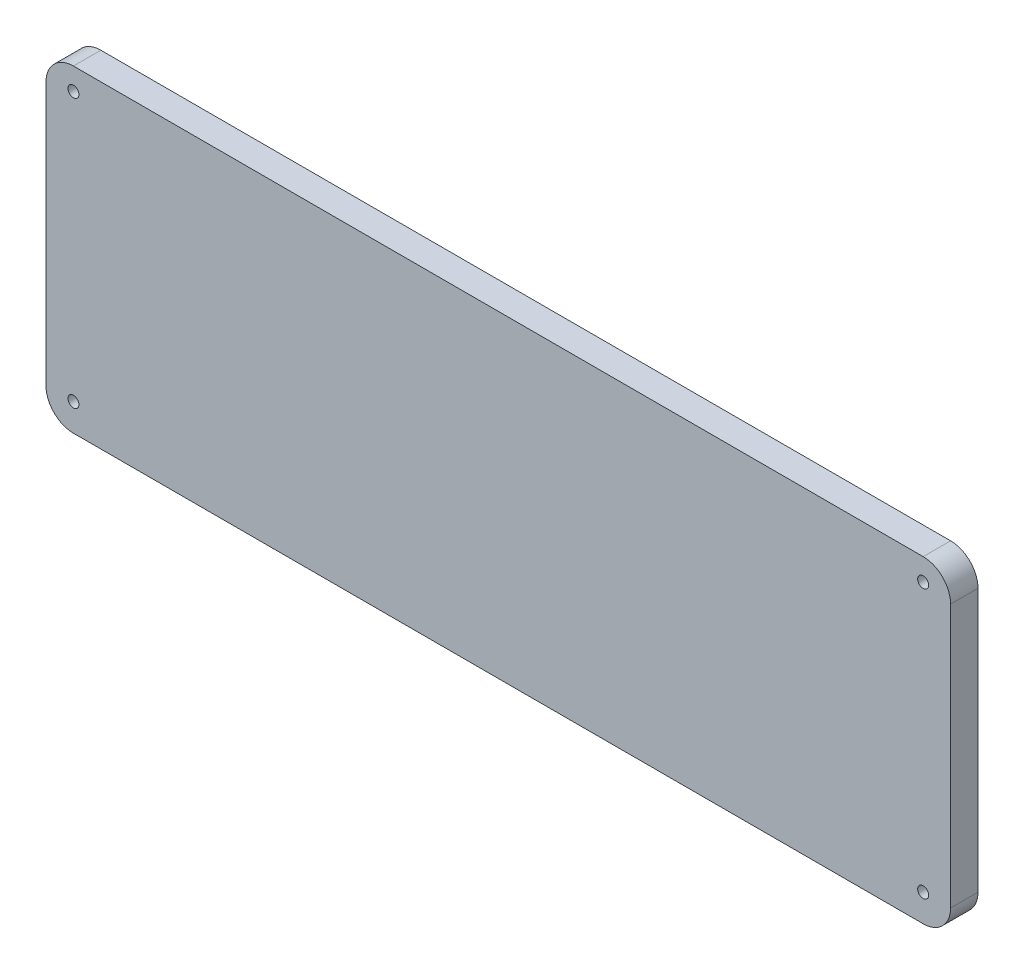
ISO-10303-21;
HEADER;
FILE_DESCRIPTION(('STEP AP214'),'2;1');
FILE_NAME('part.step','',(''),(''),'','','');
FILE_SCHEMA(('AUTOMOTIVE_DESIGN { 1 0 10303 214 1 1 1 1 }'));
ENDSEC;
DATA;
#1=APPLICATION_CONTEXT('core data for automotive mechanical design processes');
#2=APPLICATION_PROTOCOL_DEFINITION('international standard','automotive_design',2000,#1);
#3=PRODUCT_CONTEXT('',#1,'mechanical');
#4=PRODUCT('Part','Part','',(#3));
#5=PRODUCT_RELATED_PRODUCT_CATEGORY('part','',(#4));
#6=PRODUCT_DEFINITION_FORMATION('','',#4);
#7=PRODUCT_DEFINITION_CONTEXT('part definition',#1,'design');
#8=PRODUCT_DEFINITION('design','',#6,#7);
#9=PRODUCT_DEFINITION_SHAPE('','',#8);
#10=(LENGTH_UNIT() NAMED_UNIT(*) SI_UNIT(.MILLI.,.METRE.));
#11=(NAMED_UNIT(*) PLANE_ANGLE_UNIT() SI_UNIT($,.RADIAN.));
#12=(NAMED_UNIT(*) SI_UNIT($,.STERADIAN.) SOLID_ANGLE_UNIT());
#13=UNCERTAINTY_MEASURE_WITH_UNIT(LENGTH_MEASURE(1.E-05),#10,'distance_accuracy_value','');
#14=(GEOMETRIC_REPRESENTATION_CONTEXT(3) GLOBAL_UNCERTAINTY_ASSIGNED_CONTEXT((#13)) GLOBAL_UNIT_ASSIGNED_CONTEXT((#10,
#11,#12)) REPRESENTATION_CONTEXT('',''));
#15=CARTESIAN_POINT('',(0.,0.,0.));
#16=DIRECTION('',(0.,0.,1.));
#17=DIRECTION('',(1.,0.,0.));
#18=AXIS2_PLACEMENT_3D('',#15,#16,#17);
#19=CARTESIAN_POINT('',(165.,-58.,10.));
#20=DIRECTION('',(-1.,0.,0.));
#21=DIRECTION('',(0.,0.,1.));
#22=AXIS2_PLACEMENT_3D('',#19,#20,#21);
#23=PLANE('',#22);
#24=DIRECTION('',(0.,1.,0.));
#25=VECTOR('',#24,1.);
#26=CARTESIAN_POINT('',(165.,-58.,0.));
#27=LINE('',#26,#25);
#28=CARTESIAN_POINT('',(165.,-48.,0.));
#29=VERTEX_POINT('',#28);
#30=CARTESIAN_POINT('',(165.,48.,0.));
#31=VERTEX_POINT('',#30);
#32=EDGE_CURVE('E128',#29,#31,#27,.T.);
#33=ORIENTED_EDGE('',*,*,#32,.T.);
#34=DIRECTION('',(0.,0.,-1.));
#35=VECTOR('',#34,1.);
#36=CARTESIAN_POINT('',(165.,48.,10.));
#37=LINE('',#36,#35);
#38=CARTESIAN_POINT('',(165.,48.,10.));
#39=VERTEX_POINT('',#38);
#40=EDGE_CURVE('E106',#31,#39,#37,.F.);
#41=ORIENTED_EDGE('',*,*,#40,.T.);
#42=DIRECTION('',(0.,1.,0.));
#43=VECTOR('',#42,1.);
#44=CARTESIAN_POINT('',(165.,-58.,10.));
#45=LINE('',#44,#43);
#46=CARTESIAN_POINT('',(165.,-48.,10.));
#47=VERTEX_POINT('',#46);
#48=EDGE_CURVE('E138',#47,#39,#45,.T.);
#49=ORIENTED_EDGE('',*,*,#48,.F.);
#50=DIRECTION('',(0.,0.,-1.));
#51=VECTOR('',#50,1.);
#52=CARTESIAN_POINT('',(165.,-48.,10.));
#53=LINE('',#52,#51);
#54=EDGE_CURVE('E111',#47,#29,#53,.T.);
#55=ORIENTED_EDGE('',*,*,#54,.T.);
#56=EDGE_LOOP('',(#33,#41,#49,#55));
#57=FACE_BOUND('',#56,.T.);
#58=ADVANCED_FACE('F35',(#57),#23,.F.);
#59=CARTESIAN_POINT('',(-165.,58.,10.));
#60=DIRECTION('',(0.,-1.,0.));
#61=DIRECTION('',(0.,0.,-1.));
#62=AXIS2_PLACEMENT_3D('',#59,#60,#61);
#63=PLANE('',#62);
#64=DIRECTION('',(-1.,0.,0.));
#65=VECTOR('',#64,1.);
#66=CARTESIAN_POINT('',(-165.,58.,10.));
#67=LINE('',#66,#65);
#68=CARTESIAN_POINT('',(155.,58.,10.));
#69=VERTEX_POINT('',#68);
#70=CARTESIAN_POINT('',(-155.,58.,10.));
#71=VERTEX_POINT('',#70);
#72=EDGE_CURVE('E121',#69,#71,#67,.T.);
#73=ORIENTED_EDGE('',*,*,#72,.F.);
#74=DIRECTION('',(0.,0.,-1.));
#75=VECTOR('',#74,1.);
#76=CARTESIAN_POINT('',(155.,58.,10.));
#77=LINE('',#76,#75);
#78=CARTESIAN_POINT('',(155.,58.,0.));
#79=VERTEX_POINT('',#78);
#80=EDGE_CURVE('E105',#69,#79,#77,.T.);
#81=ORIENTED_EDGE('',*,*,#80,.T.);
#82=DIRECTION('',(-1.,0.,0.));
#83=VECTOR('',#82,1.);
#84=CARTESIAN_POINT('',(-165.,58.,0.));
#85=LINE('',#84,#83);
#86=CARTESIAN_POINT('',(-155.,58.,0.));
#87=VERTEX_POINT('',#86);
#88=EDGE_CURVE('E118',#79,#87,#85,.T.);
#89=ORIENTED_EDGE('',*,*,#88,.T.);
#90=DIRECTION('',(0.,0.,-1.));
#91=VECTOR('',#90,1.);
#92=CARTESIAN_POINT('',(-155.,58.,10.));
#93=LINE('',#92,#91);
#94=EDGE_CURVE('E123',#87,#71,#93,.F.);
#95=ORIENTED_EDGE('',*,*,#94,.T.);
#96=EDGE_LOOP('',(#73,#81,#89,#95));
#97=FACE_BOUND('',#96,.T.);
#98=ADVANCED_FACE('F117',(#97),#63,.F.);
#99=CARTESIAN_POINT('',(-165.,-58.,10.));
#100=DIRECTION('',(1.,0.,0.));
#101=DIRECTION('',(0.,0.,-1.));
#102=AXIS2_PLACEMENT_3D('',#99,#100,#101);
#103=PLANE('',#102);
#104=DIRECTION('',(0.,-1.,0.));
#105=VECTOR('',#104,1.);
#106=CARTESIAN_POINT('',(-165.,-58.,0.));
#107=LINE('',#106,#105);
#108=CARTESIAN_POINT('',(-165.,48.,0.));
#109=VERTEX_POINT('',#108);
#110=CARTESIAN_POINT('',(-165.,-48.,0.));
#111=VERTEX_POINT('',#110);
#112=EDGE_CURVE('E127',#109,#111,#107,.T.);
#113=ORIENTED_EDGE('',*,*,#112,.T.);
#114=DIRECTION('',(0.,0.,-1.));
#115=VECTOR('',#114,1.);
#116=CARTESIAN_POINT('',(-165.,-48.,10.));
#117=LINE('',#116,#115);
#118=CARTESIAN_POINT('',(-165.,-48.,10.));
#119=VERTEX_POINT('',#118);
#120=EDGE_CURVE('E11',#111,#119,#117,.F.);
#121=ORIENTED_EDGE('',*,*,#120,.T.);
#122=DIRECTION('',(0.,-1.,0.));
#123=VECTOR('',#122,1.);
#124=CARTESIAN_POINT('',(-165.,-58.,10.));
#125=LINE('',#124,#123);
#126=CARTESIAN_POINT('',(-165.,48.,10.));
#127=VERTEX_POINT('',#126);
#128=EDGE_CURVE('E164',#127,#119,#125,.T.);
#129=ORIENTED_EDGE('',*,*,#128,.F.);
#130=DIRECTION('',(0.,0.,-1.));
#131=VECTOR('',#130,1.);
#132=CARTESIAN_POINT('',(-165.,48.,10.));
#133=LINE('',#132,#131);
#134=EDGE_CURVE('E43',#127,#109,#133,.T.);
#135=ORIENTED_EDGE('',*,*,#134,.T.);
#136=EDGE_LOOP('',(#113,#121,#129,#135));
#137=FACE_BOUND('',#136,.T.);
#138=ADVANCED_FACE('F162',(#137),#103,.F.);
#139=CARTESIAN_POINT('',(-165.,-58.,10.));
#140=DIRECTION('',(0.,1.,0.));
#141=DIRECTION('',(0.,0.,1.));
#142=AXIS2_PLACEMENT_3D('',#139,#140,#141);
#143=PLANE('',#142);
#144=DIRECTION('',(1.,0.,0.));
#145=VECTOR('',#144,1.);
#146=CARTESIAN_POINT('',(-165.,-58.,0.));
#147=LINE('',#146,#145);
#148=CARTESIAN_POINT('',(-155.,-58.,0.));
#149=VERTEX_POINT('',#148);
#150=CARTESIAN_POINT('',(155.,-58.,0.));
#151=VERTEX_POINT('',#150);
#152=EDGE_CURVE('E131',#149,#151,#147,.T.);
#153=ORIENTED_EDGE('',*,*,#152,.T.);
#154=DIRECTION('',(0.,0.,-1.));
#155=VECTOR('',#154,1.);
#156=CARTESIAN_POINT('',(155.,-58.,10.));
#157=LINE('',#156,#155);
#158=CARTESIAN_POINT('',(155.,-58.,10.));
#159=VERTEX_POINT('',#158);
#160=EDGE_CURVE('E50',#151,#159,#157,.F.);
#161=ORIENTED_EDGE('',*,*,#160,.T.);
#162=DIRECTION('',(1.,0.,0.));
#163=VECTOR('',#162,1.);
#164=CARTESIAN_POINT('',(-165.,-58.,10.));
#165=LINE('',#164,#163);
#166=CARTESIAN_POINT('',(-155.,-58.,10.));
#167=VERTEX_POINT('',#166);
#168=EDGE_CURVE('E139',#167,#159,#165,.T.);
#169=ORIENTED_EDGE('',*,*,#168,.F.);
#170=DIRECTION('',(0.,0.,-1.));
#171=VECTOR('',#170,1.);
#172=CARTESIAN_POINT('',(-155.,-58.,10.));
#173=LINE('',#172,#171);
#174=EDGE_CURVE('E155',#167,#149,#173,.T.);
#175=ORIENTED_EDGE('',*,*,#174,.T.);
#176=EDGE_LOOP('',(#153,#161,#169,#175));
#177=FACE_BOUND('',#176,.T.);
#178=ADVANCED_FACE('F171',(#177),#143,.F.);
#179=CARTESIAN_POINT('',(0.,0.,10.));
#180=DIRECTION('',(0.,0.,-1.));
#181=DIRECTION('',(-1.,0.,0.));
#182=AXIS2_PLACEMENT_3D('',#179,#180,#181);
#183=PLANE('',#182);
#184=CARTESIAN_POINT('',(-155.,49.9499999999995,10.));
#185=DIRECTION('',(0.,0.,1.));
#186=DIRECTION('',(1.,0.,0.));
#187=AXIS2_PLACEMENT_3D('',#184,#185,#186);
#188=CIRCLE('',#187,2.00102409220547);
#189=CARTESIAN_POINT('',(-152.998975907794,49.9499999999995,10.));
#190=VERTEX_POINT('',#189);
#191=EDGE_CURVE('E191',#190,#190,#188,.T.);
#192=ORIENTED_EDGE('',*,*,#191,.F.);
#193=EDGE_LOOP('',(#192));
#194=FACE_BOUND('',#193,.T.);
#195=CARTESIAN_POINT('',(155.,-48.,10.));
#196=DIRECTION('',(0.,0.,1.));
#197=DIRECTION('',(1.,0.,0.));
#198=AXIS2_PLACEMENT_3D('',#195,#196,#197);
#199=CIRCLE('',#198,2.);
#200=CARTESIAN_POINT('',(157.,-48.,10.));
#201=VERTEX_POINT('',#200);
#202=EDGE_CURVE('E184',#201,#201,#199,.T.);
#203=ORIENTED_EDGE('',*,*,#202,.F.);
#204=EDGE_LOOP('',(#203));
#205=FACE_BOUND('',#204,.T.);
#206=CARTESIAN_POINT('',(155.,49.95,10.));
#207=DIRECTION('',(0.,0.,1.));
#208=DIRECTION('',(1.,0.,0.));
#209=AXIS2_PLACEMENT_3D('',#206,#207,#208);
#210=CIRCLE('',#209,2.);
#211=CARTESIAN_POINT('',(157.,49.95,10.));
#212=VERTEX_POINT('',#211);
#213=EDGE_CURVE('E196',#212,#212,#210,.T.);
#214=ORIENTED_EDGE('',*,*,#213,.F.);
#215=EDGE_LOOP('',(#214));
#216=FACE_BOUND('',#215,.T.);
#217=CARTESIAN_POINT('',(-155.,-48.,10.));
#218=DIRECTION('',(0.,0.,1.));
#219=DIRECTION('',(1.,0.,0.));
#220=AXIS2_PLACEMENT_3D('',#217,#218,#219);
#221=CIRCLE('',#220,2.);
#222=CARTESIAN_POINT('',(-153.,-48.,10.));
#223=VERTEX_POINT('',#222);
#224=EDGE_CURVE('E178',#223,#223,#221,.T.);
#225=ORIENTED_EDGE('',*,*,#224,.F.);
#226=EDGE_LOOP('',(#225));
#227=FACE_BOUND('',#226,.T.);
#228=ORIENTED_EDGE('',*,*,#48,.T.);
#229=CARTESIAN_POINT('',(155.,48.,10.));
#230=DIRECTION('',(0.,0.,-1.));
#231=DIRECTION('',(-1.,0.,0.));
#232=AXIS2_PLACEMENT_3D('',#229,#230,#231);
#233=CIRCLE('',#232,10.);
#234=EDGE_CURVE('E153',#39,#69,#233,.F.);
#235=ORIENTED_EDGE('',*,*,#234,.T.);
#236=ORIENTED_EDGE('',*,*,#72,.T.);
#237=CARTESIAN_POINT('',(-155.,48.,10.));
#238=DIRECTION('',(0.,0.,-1.));
#239=DIRECTION('',(-1.,0.,0.));
#240=AXIS2_PLACEMENT_3D('',#237,#238,#239);
#241=CIRCLE('',#240,10.);
#242=EDGE_CURVE('E148',#71,#127,#241,.F.);
#243=ORIENTED_EDGE('',*,*,#242,.T.);
#244=ORIENTED_EDGE('',*,*,#128,.T.);
#245=CARTESIAN_POINT('',(-155.,-48.,10.));
#246=DIRECTION('',(0.,0.,-1.));
#247=DIRECTION('',(-1.,0.,0.));
#248=AXIS2_PLACEMENT_3D('',#245,#246,#247);
#249=CIRCLE('',#248,10.);
#250=EDGE_CURVE('E57',#119,#167,#249,.F.);
#251=ORIENTED_EDGE('',*,*,#250,.T.);
#252=ORIENTED_EDGE('',*,*,#168,.T.);
#253=CARTESIAN_POINT('',(155.,-48.,10.));
#254=DIRECTION('',(0.,0.,-1.));
#255=DIRECTION('',(-1.,0.,0.));
#256=AXIS2_PLACEMENT_3D('',#253,#254,#255);
#257=CIRCLE('',#256,10.);
#258=EDGE_CURVE('E151',#159,#47,#257,.F.);
#259=ORIENTED_EDGE('',*,*,#258,.T.);
#260=EDGE_LOOP('',(#228,#235,#236,#243,#244,#251,#252,#259));
#261=FACE_BOUND('',#260,.T.);
#262=ADVANCED_FACE('F212',(#194,#205,#216,#227,#261),#183,.F.);
#263=CARTESIAN_POINT('',(0.,0.,0.));
#264=DIRECTION('',(0.,0.,-1.));
#265=DIRECTION('',(-1.,0.,0.));
#266=AXIS2_PLACEMENT_3D('',#263,#264,#265);
#267=PLANE('',#266);
#268=CARTESIAN_POINT('',(-155.,49.9499999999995,0.));
#269=DIRECTION('',(0.,0.,1.));
#270=DIRECTION('',(1.,0.,0.));
#271=AXIS2_PLACEMENT_3D('',#268,#269,#270);
#272=CIRCLE('',#271,2.00102409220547);
#273=CARTESIAN_POINT('',(-152.998975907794,49.9499999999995,0.));
#274=VERTEX_POINT('',#273);
#275=EDGE_CURVE('E181',#274,#274,#272,.T.);
#276=ORIENTED_EDGE('',*,*,#275,.T.);
#277=EDGE_LOOP('',(#276));
#278=FACE_BOUND('',#277,.T.);
#279=CARTESIAN_POINT('',(155.,-48.,0.));
#280=DIRECTION('',(0.,0.,1.));
#281=DIRECTION('',(1.,0.,0.));
#282=AXIS2_PLACEMENT_3D('',#279,#280,#281);
#283=CIRCLE('',#282,2.);
#284=CARTESIAN_POINT('',(157.,-48.,0.));
#285=VERTEX_POINT('',#284);
#286=EDGE_CURVE('E187',#285,#285,#283,.T.);
#287=ORIENTED_EDGE('',*,*,#286,.T.);
#288=EDGE_LOOP('',(#287));
#289=FACE_BOUND('',#288,.T.);
#290=CARTESIAN_POINT('',(155.,49.95,0.));
#291=DIRECTION('',(0.,0.,1.));
#292=DIRECTION('',(1.,0.,0.));
#293=AXIS2_PLACEMENT_3D('',#290,#291,#292);
#294=CIRCLE('',#293,2.);
#295=CARTESIAN_POINT('',(157.,49.95,0.));
#296=VERTEX_POINT('',#295);
#297=EDGE_CURVE('E188',#296,#296,#294,.T.);
#298=ORIENTED_EDGE('',*,*,#297,.T.);
#299=EDGE_LOOP('',(#298));
#300=FACE_BOUND('',#299,.T.);
#301=CARTESIAN_POINT('',(-155.,-48.,0.));
#302=DIRECTION('',(0.,0.,1.));
#303=DIRECTION('',(1.,0.,0.));
#304=AXIS2_PLACEMENT_3D('',#301,#302,#303);
#305=CIRCLE('',#304,2.);
#306=CARTESIAN_POINT('',(-153.,-48.,0.));
#307=VERTEX_POINT('',#306);
#308=EDGE_CURVE('E133',#307,#307,#305,.T.);
#309=ORIENTED_EDGE('',*,*,#308,.T.);
#310=EDGE_LOOP('',(#309));
#311=FACE_BOUND('',#310,.T.);
#312=ORIENTED_EDGE('',*,*,#88,.F.);
#313=CARTESIAN_POINT('',(155.,48.,0.));
#314=DIRECTION('',(0.,0.,-1.));
#315=DIRECTION('',(-1.,0.,0.));
#316=AXIS2_PLACEMENT_3D('',#313,#314,#315);
#317=CIRCLE('',#316,10.);
#318=EDGE_CURVE('E101',#79,#31,#317,.T.);
#319=ORIENTED_EDGE('',*,*,#318,.T.);
#320=ORIENTED_EDGE('',*,*,#32,.F.);
#321=CARTESIAN_POINT('',(155.,-48.,0.));
#322=DIRECTION('',(0.,0.,-1.));
#323=DIRECTION('',(-1.,0.,0.));
#324=AXIS2_PLACEMENT_3D('',#321,#322,#323);
#325=CIRCLE('',#324,10.);
#326=EDGE_CURVE('E112',#29,#151,#325,.T.);
#327=ORIENTED_EDGE('',*,*,#326,.T.);
#328=ORIENTED_EDGE('',*,*,#152,.F.);
#329=CARTESIAN_POINT('',(-155.,-48.,0.));
#330=DIRECTION('',(0.,0.,-1.));
#331=DIRECTION('',(-1.,0.,0.));
#332=AXIS2_PLACEMENT_3D('',#329,#330,#331);
#333=CIRCLE('',#332,10.);
#334=EDGE_CURVE('E142',#149,#111,#333,.T.);
#335=ORIENTED_EDGE('',*,*,#334,.T.);
#336=ORIENTED_EDGE('',*,*,#112,.F.);
#337=CARTESIAN_POINT('',(-155.,48.,0.));
#338=DIRECTION('',(0.,0.,-1.));
#339=DIRECTION('',(-1.,0.,0.));
#340=AXIS2_PLACEMENT_3D('',#337,#338,#339);
#341=CIRCLE('',#340,10.);
#342=EDGE_CURVE('E122',#109,#87,#341,.T.);
#343=ORIENTED_EDGE('',*,*,#342,.T.);
#344=EDGE_LOOP('',(#312,#319,#320,#327,#328,#335,#336,#343));
#345=FACE_BOUND('',#344,.T.);
#346=ADVANCED_FACE('F125',(#278,#289,#300,#311,#345),#267,.T.);
#347=CARTESIAN_POINT('',(155.,48.,10.));
#348=DIRECTION('',(0.,0.,-1.));
#349=DIRECTION('',(-1.,0.,0.));
#350=AXIS2_PLACEMENT_3D('',#347,#348,#349);
#351=CYLINDRICAL_SURFACE('',#350,10.);
#352=ORIENTED_EDGE('',*,*,#234,.F.);
#353=ORIENTED_EDGE('',*,*,#40,.F.);
#354=ORIENTED_EDGE('',*,*,#318,.F.);
#355=ORIENTED_EDGE('',*,*,#80,.F.);
#356=EDGE_LOOP('',(#352,#353,#354,#355));
#357=FACE_BOUND('',#356,.T.);
#358=ADVANCED_FACE('F104',(#357),#351,.T.);
#359=CARTESIAN_POINT('',(155.,-48.,10.));
#360=DIRECTION('',(0.,0.,-1.));
#361=DIRECTION('',(-1.,0.,0.));
#362=AXIS2_PLACEMENT_3D('',#359,#360,#361);
#363=CYLINDRICAL_SURFACE('',#362,10.);
#364=ORIENTED_EDGE('',*,*,#258,.F.);
#365=ORIENTED_EDGE('',*,*,#160,.F.);
#366=ORIENTED_EDGE('',*,*,#326,.F.);
#367=ORIENTED_EDGE('',*,*,#54,.F.);
#368=EDGE_LOOP('',(#364,#365,#366,#367));
#369=FACE_BOUND('',#368,.T.);
#370=ADVANCED_FACE('F222',(#369),#363,.T.);
#371=CARTESIAN_POINT('',(-155.,-48.,10.));
#372=DIRECTION('',(0.,0.,-1.));
#373=DIRECTION('',(-1.,0.,0.));
#374=AXIS2_PLACEMENT_3D('',#371,#372,#373);
#375=CYLINDRICAL_SURFACE('',#374,10.);
#376=ORIENTED_EDGE('',*,*,#250,.F.);
#377=ORIENTED_EDGE('',*,*,#120,.F.);
#378=ORIENTED_EDGE('',*,*,#334,.F.);
#379=ORIENTED_EDGE('',*,*,#174,.F.);
#380=EDGE_LOOP('',(#376,#377,#378,#379));
#381=FACE_BOUND('',#380,.T.);
#382=ADVANCED_FACE('F170',(#381),#375,.T.);
#383=CARTESIAN_POINT('',(-155.,48.,10.));
#384=DIRECTION('',(0.,0.,-1.));
#385=DIRECTION('',(-1.,0.,0.));
#386=AXIS2_PLACEMENT_3D('',#383,#384,#385);
#387=CYLINDRICAL_SURFACE('',#386,10.);
#388=ORIENTED_EDGE('',*,*,#242,.F.);
#389=ORIENTED_EDGE('',*,*,#94,.F.);
#390=ORIENTED_EDGE('',*,*,#342,.F.);
#391=ORIENTED_EDGE('',*,*,#134,.F.);
#392=EDGE_LOOP('',(#388,#389,#390,#391));
#393=FACE_BOUND('',#392,.T.);
#394=ADVANCED_FACE('F37',(#393),#387,.T.);
#395=CARTESIAN_POINT('',(-155.,-48.,0.));
#396=DIRECTION('',(0.,0.,1.));
#397=DIRECTION('',(1.,0.,0.));
#398=AXIS2_PLACEMENT_3D('',#395,#396,#397);
#399=CYLINDRICAL_SURFACE('',#398,2.);
#400=ORIENTED_EDGE('',*,*,#308,.F.);
#401=EDGE_LOOP('',(#400));
#402=FACE_BOUND('',#401,.T.);
#403=ORIENTED_EDGE('',*,*,#224,.T.);
#404=EDGE_LOOP('',(#403));
#405=FACE_BOUND('',#404,.T.);
#406=ADVANCED_FACE('F208',(#402,#405),#399,.F.);
#407=CARTESIAN_POINT('',(155.,49.95,0.));
#408=DIRECTION('',(0.,0.,1.));
#409=DIRECTION('',(1.,0.,0.));
#410=AXIS2_PLACEMENT_3D('',#407,#408,#409);
#411=CYLINDRICAL_SURFACE('',#410,2.);
#412=ORIENTED_EDGE('',*,*,#297,.F.);
#413=EDGE_LOOP('',(#412));
#414=FACE_BOUND('',#413,.T.);
#415=ORIENTED_EDGE('',*,*,#213,.T.);
#416=EDGE_LOOP('',(#415));
#417=FACE_BOUND('',#416,.T.);
#418=ADVANCED_FACE('F204',(#414,#417),#411,.F.);
#419=CARTESIAN_POINT('',(155.,-48.,0.));
#420=DIRECTION('',(0.,0.,1.));
#421=DIRECTION('',(1.,0.,0.));
#422=AXIS2_PLACEMENT_3D('',#419,#420,#421);
#423=CYLINDRICAL_SURFACE('',#422,2.);
#424=ORIENTED_EDGE('',*,*,#286,.F.);
#425=EDGE_LOOP('',(#424));
#426=FACE_BOUND('',#425,.T.);
#427=ORIENTED_EDGE('',*,*,#202,.T.);
#428=EDGE_LOOP('',(#427));
#429=FACE_BOUND('',#428,.T.);
#430=ADVANCED_FACE('F207',(#426,#429),#423,.F.);
#431=CARTESIAN_POINT('',(-155.,49.9499999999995,0.));
#432=DIRECTION('',(0.,0.,1.));
#433=DIRECTION('',(1.,0.,0.));
#434=AXIS2_PLACEMENT_3D('',#431,#432,#433);
#435=CYLINDRICAL_SURFACE('',#434,2.00102409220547);
#436=ORIENTED_EDGE('',*,*,#275,.F.);
#437=EDGE_LOOP('',(#436));
#438=FACE_BOUND('',#437,.T.);
#439=ORIENTED_EDGE('',*,*,#191,.T.);
#440=EDGE_LOOP('',(#439));
#441=FACE_BOUND('',#440,.T.);
#442=ADVANCED_FACE('F249',(#438,#441),#435,.F.);
#443=CLOSED_SHELL('',(#58,#98,#138,#178,#262,#346,#358,#370,#382,#394,#406,#418,#430,#442));
#444=MANIFOLD_SOLID_BREP('B2',#443);
#445=ADVANCED_BREP_SHAPE_REPRESENTATION('',(#18,#444),#14);
#446=SHAPE_DEFINITION_REPRESENTATION(#9,#445);
ENDSEC;
END-ISO-10303-21;
